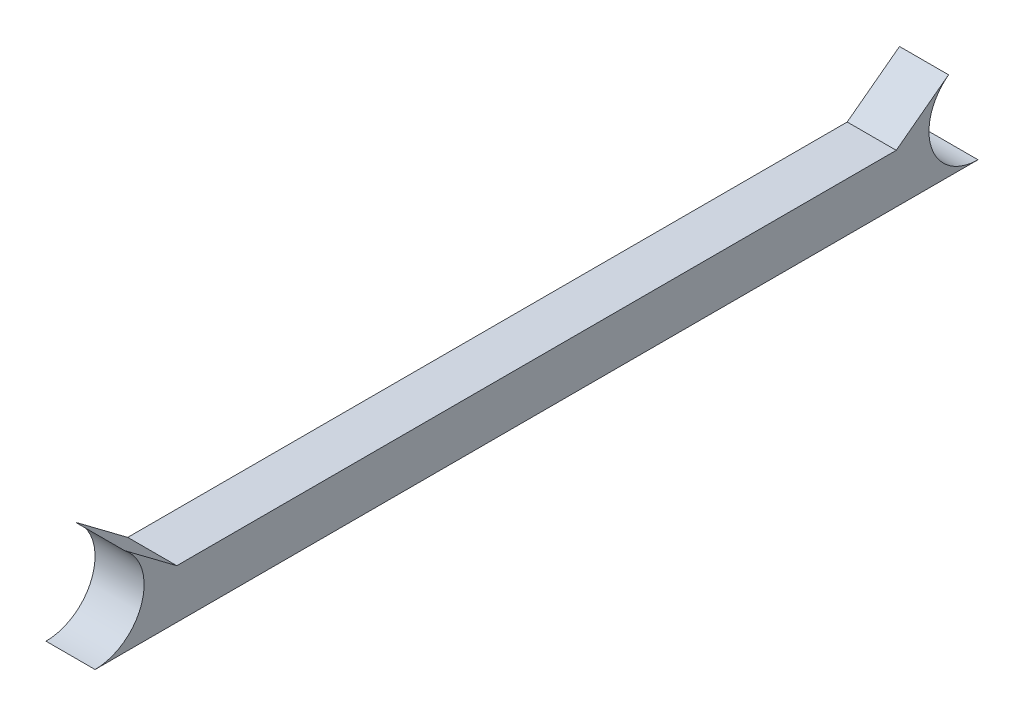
from build123d import *

# Parameters (mm, degrees)
BOSS_EXTRUDE1_DEPTH = 22.5


with BuildPart() as part:
    # Sketch1 → Boss-Extrude1 (new, symmetric)
    with BuildSketch(Plane(origin=(0, 0, 0), x_dir=(0, 0, -1), z_dir=(1, 0, 0))):
        with BuildLine():
            Line((0, -45), (810, -45))
            ThreePointArc((810, -45), (767.309251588, -14.230249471), (783, 36))
            Line((783, 36), (735, 0))
            Line((735, 0), (75, 0))
            Line((75, 0), (27, 36))
            ThreePointArc((27, 36), (42.690748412, -14.230249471), (0, -45))
        make_face()
    extrude(amount=BOSS_EXTRUDE1_DEPTH, both=True)


solid = part.part
